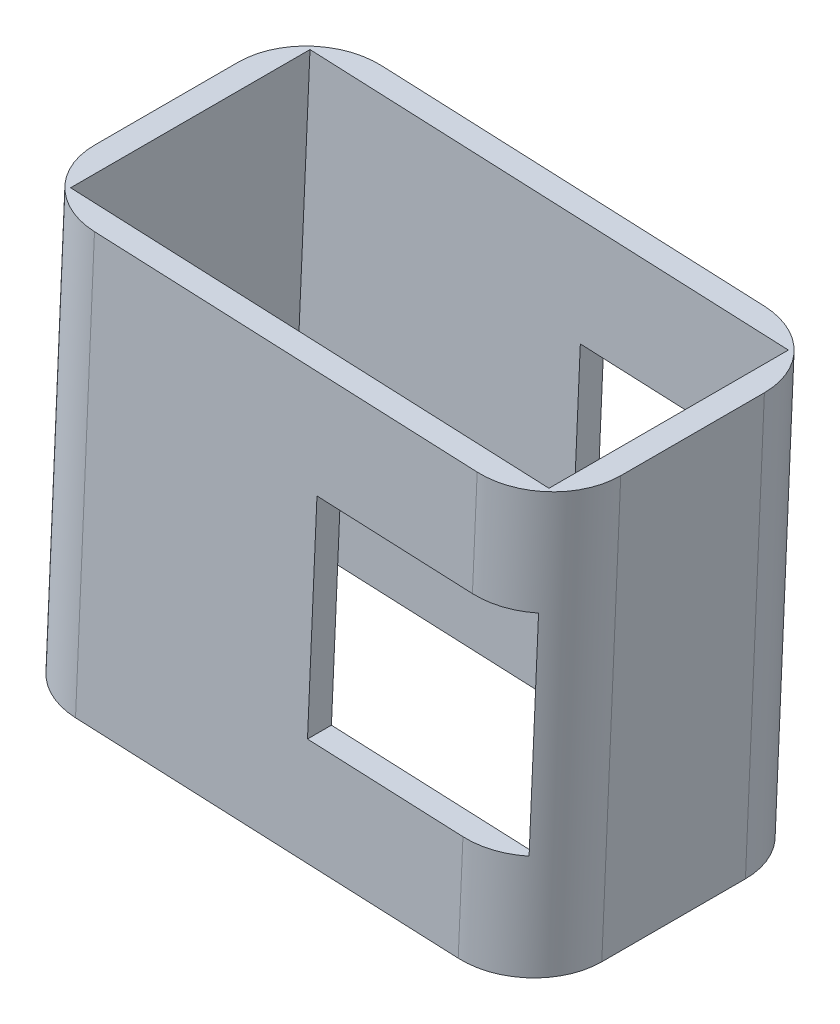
ISO-10303-21;
HEADER;
FILE_DESCRIPTION(('STEP AP214'),'2;1');
FILE_NAME('part.step','',(''),(''),'','','');
FILE_SCHEMA(('AUTOMOTIVE_DESIGN { 1 0 10303 214 1 1 1 1 }'));
ENDSEC;
DATA;
#1=APPLICATION_CONTEXT('core data for automotive mechanical design processes');
#2=APPLICATION_PROTOCOL_DEFINITION('international standard','automotive_design',2000,#1);
#3=PRODUCT_CONTEXT('',#1,'mechanical');
#4=PRODUCT('Part','Part','',(#3));
#5=PRODUCT_RELATED_PRODUCT_CATEGORY('part','',(#4));
#6=PRODUCT_DEFINITION_FORMATION('','',#4);
#7=PRODUCT_DEFINITION_CONTEXT('part definition',#1,'design');
#8=PRODUCT_DEFINITION('design','',#6,#7);
#9=PRODUCT_DEFINITION_SHAPE('','',#8);
#10=(LENGTH_UNIT() NAMED_UNIT(*) SI_UNIT(.MILLI.,.METRE.));
#11=(NAMED_UNIT(*) PLANE_ANGLE_UNIT() SI_UNIT($,.RADIAN.));
#12=(NAMED_UNIT(*) SI_UNIT($,.STERADIAN.) SOLID_ANGLE_UNIT());
#13=UNCERTAINTY_MEASURE_WITH_UNIT(LENGTH_MEASURE(1.E-05),#10,'distance_accuracy_value','');
#14=(GEOMETRIC_REPRESENTATION_CONTEXT(3) GLOBAL_UNCERTAINTY_ASSIGNED_CONTEXT((#13)) GLOBAL_UNIT_ASSIGNED_CONTEXT((#10,
#11,#12)) REPRESENTATION_CONTEXT('',''));
#15=CARTESIAN_POINT('',(0.,0.,0.));
#16=DIRECTION('',(0.,0.,1.));
#17=DIRECTION('',(1.,0.,0.));
#18=AXIS2_PLACEMENT_3D('',#15,#16,#17);
#19=CARTESIAN_POINT('',(-43.1975486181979,10.6937272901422,-39.1));
#20=DIRECTION('',(-0.999030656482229,0.0440198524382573,0.));
#21=DIRECTION('',(-0.0440198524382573,-0.999030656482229,0.));
#22=AXIS2_PLACEMENT_3D('',#19,#20,#21);
#23=PLANE('',#22);
#24=DIRECTION('',(0.,0.,1.));
#25=VECTOR('',#24,1.);
#26=CARTESIAN_POINT('',(-43.5937272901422,1.70245138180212,-39.1));
#27=LINE('',#26,#25);
#28=CARTESIAN_POINT('',(-43.5937272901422,1.70245138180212,-39.1));
#29=VERTEX_POINT('',#28);
#30=CARTESIAN_POINT('',(-43.5937272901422,1.70245138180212,-38.1));
#31=VERTEX_POINT('',#30);
#32=EDGE_CURVE('E188',#29,#31,#27,.T.);
#33=ORIENTED_EDGE('',*,*,#32,.F.);
#34=DIRECTION('',(-0.0440198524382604,-0.999030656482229,0.));
#35=VECTOR('',#34,1.);
#36=CARTESIAN_POINT('',(-43.1975486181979,10.6937272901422,-39.1));
#37=LINE('',#36,#35);
#38=CARTESIAN_POINT('',(-43.1975486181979,10.6937272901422,-39.1));
#39=VERTEX_POINT('',#38);
#40=EDGE_CURVE('E152',#39,#29,#37,.T.);
#41=ORIENTED_EDGE('',*,*,#40,.F.);
#42=DIRECTION('',(0.,0.,1.));
#43=VECTOR('',#42,1.);
#44=CARTESIAN_POINT('',(-43.1975486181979,10.6937272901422,-39.1));
#45=LINE('',#44,#43);
#46=CARTESIAN_POINT('',(-43.1975486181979,10.6937272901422,-38.1));
#47=VERTEX_POINT('',#46);
#48=EDGE_CURVE('E180',#47,#39,#45,.F.);
#49=ORIENTED_EDGE('',*,*,#48,.F.);
#50=DIRECTION('',(0.0440198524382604,0.999030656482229,0.));
#51=VECTOR('',#50,1.);
#52=CARTESIAN_POINT('',(-43.5937272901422,1.70245138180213,-38.1));
#53=LINE('',#52,#51);
#54=EDGE_CURVE('E209',#31,#47,#53,.T.);
#55=ORIENTED_EDGE('',*,*,#54,.F.);
#56=EDGE_LOOP('',(#33,#41,#49,#55));
#57=FACE_BOUND('',#56,.T.);
#58=ADVANCED_FACE('F17',(#57),#23,.F.);
#59=CARTESIAN_POINT('',(-35.1019667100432,1.32828263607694,-39.1));
#60=DIRECTION('',(0.0440198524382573,0.999030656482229,0.));
#61=DIRECTION('',(-0.999030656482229,0.0440198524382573,0.));
#62=AXIS2_PLACEMENT_3D('',#59,#60,#61);
#63=PLANE('',#62);
#64=DIRECTION('',(0.999030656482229,-0.0440198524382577,0.));
#65=VECTOR('',#64,1.);
#66=CARTESIAN_POINT('',(-43.5937272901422,1.70245138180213,-39.1));
#67=LINE('',#66,#65);
#68=CARTESIAN_POINT('',(-37.1000280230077,1.41632234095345,-39.1));
#69=VERTEX_POINT('',#68);
#70=EDGE_CURVE('E144',#29,#69,#67,.T.);
#71=ORIENTED_EDGE('',*,*,#70,.F.);
#72=ORIENTED_EDGE('',*,*,#32,.T.);
#73=DIRECTION('',(-0.999030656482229,0.0440198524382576,0.));
#74=VECTOR('',#73,1.);
#75=CARTESIAN_POINT('',(-35.1019667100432,1.32828263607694,-38.1));
#76=LINE('',#75,#74);
#77=CARTESIAN_POINT('',(-35.1019667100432,1.32828263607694,-38.1));
#78=VERTEX_POINT('',#77);
#79=EDGE_CURVE('E221',#78,#31,#76,.T.);
#80=ORIENTED_EDGE('',*,*,#79,.F.);
#81=DIRECTION('',(0.,0.,1.));
#82=VECTOR('',#81,1.);
#83=CARTESIAN_POINT('',(-35.1019667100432,1.32828263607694,-39.1));
#84=LINE('',#83,#82);
#85=CARTESIAN_POINT('',(-35.1019667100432,1.32828263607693,-38.3360679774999));
#86=VERTEX_POINT('',#85);
#87=EDGE_CURVE('E160',#78,#86,#84,.F.);
#88=ORIENTED_EDGE('',*,*,#87,.T.);
#89=CARTESIAN_POINT('',(-37.1000280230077,1.41632234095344,-36.1));
#90=DIRECTION('',(0.0440198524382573,0.999030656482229,0.));
#91=DIRECTION('',(-0.999030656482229,0.0440198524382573,0.));
#92=AXIS2_PLACEMENT_3D('',#89,#90,#91);
#93=CIRCLE('',#92,3.);
#94=EDGE_CURVE('E20',#69,#86,#93,.F.);
#95=ORIENTED_EDGE('',*,*,#94,.F.);
#96=EDGE_LOOP('',(#71,#72,#80,#88,#95));
#97=FACE_BOUND('',#96,.T.);
#98=ADVANCED_FACE('F158',(#97),#63,.T.);
#99=CARTESIAN_POINT('',(-43.1975486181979,10.6937272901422,-39.1));
#100=DIRECTION('',(-0.0440198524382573,-0.999030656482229,0.));
#101=DIRECTION('',(0.999030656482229,-0.0440198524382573,0.));
#102=AXIS2_PLACEMENT_3D('',#99,#100,#101);
#103=PLANE('',#102);
#104=CARTESIAN_POINT('',(-36.7038493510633,10.4075982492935,-36.1));
#105=DIRECTION('',(0.0440198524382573,0.999030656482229,0.));
#106=DIRECTION('',(-0.999030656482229,0.0440198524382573,0.));
#107=AXIS2_PLACEMENT_3D('',#104,#105,#106);
#108=CIRCLE('',#107,3.);
#109=CARTESIAN_POINT('',(-34.7057880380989,10.319558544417,-38.3360679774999));
#110=VERTEX_POINT('',#109);
#111=CARTESIAN_POINT('',(-36.7038493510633,10.4075982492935,-39.1));
#112=VERTEX_POINT('',#111);
#113=EDGE_CURVE('E164',#110,#112,#108,.T.);
#114=ORIENTED_EDGE('',*,*,#113,.F.);
#115=DIRECTION('',(0.,0.,1.));
#116=VECTOR('',#115,1.);
#117=CARTESIAN_POINT('',(-34.7057880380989,10.319558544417,-39.1));
#118=LINE('',#117,#116);
#119=CARTESIAN_POINT('',(-34.7057880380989,10.319558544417,-38.1));
#120=VERTEX_POINT('',#119);
#121=EDGE_CURVE('E178',#110,#120,#118,.T.);
#122=ORIENTED_EDGE('',*,*,#121,.T.);
#123=DIRECTION('',(0.999030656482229,-0.0440198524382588,0.));
#124=VECTOR('',#123,1.);
#125=CARTESIAN_POINT('',(-43.1975486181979,10.6937272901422,-38.1));
#126=LINE('',#125,#124);
#127=EDGE_CURVE('E206',#47,#120,#126,.T.);
#128=ORIENTED_EDGE('',*,*,#127,.F.);
#129=ORIENTED_EDGE('',*,*,#48,.T.);
#130=DIRECTION('',(-0.999030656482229,0.0440198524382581,0.));
#131=VECTOR('',#130,1.);
#132=CARTESIAN_POINT('',(-36.7038493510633,10.4075982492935,-39.1));
#133=LINE('',#132,#131);
#134=EDGE_CURVE('E193',#112,#39,#133,.T.);
#135=ORIENTED_EDGE('',*,*,#134,.F.);
#136=EDGE_LOOP('',(#114,#122,#128,#129,#135));
#137=FACE_BOUND('',#136,.T.);
#138=ADVANCED_FACE('F453',(#137),#103,.T.);
#139=CARTESIAN_POINT('',(-55.8835211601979,6.74833749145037,-39.1));
#140=DIRECTION('',(-0.999030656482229,0.0440198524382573,0.));
#141=DIRECTION('',(-0.0440198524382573,-0.999030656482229,0.));
#142=AXIS2_PLACEMENT_3D('',#139,#140,#141);
#143=PLANE('',#142);
#144=DIRECTION('',(0.,0.,1.));
#145=VECTOR('',#144,1.);
#146=CARTESIAN_POINT('',(-55.4873424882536,15.7396133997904,-33.1));
#147=LINE('',#146,#145);
#148=CARTESIAN_POINT('',(-55.4873424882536,15.7396133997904,-36.1));
#149=VERTEX_POINT('',#148);
#150=CARTESIAN_POINT('',(-55.4873424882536,15.7396133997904,-30.1));
#151=VERTEX_POINT('',#150);
#152=EDGE_CURVE('E259',#149,#151,#147,.T.);
#153=ORIENTED_EDGE('',*,*,#152,.F.);
#154=DIRECTION('',(0.0440198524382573,0.999030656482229,0.));
#155=VECTOR('',#154,1.);
#156=CARTESIAN_POINT('',(-55.8835211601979,6.74833749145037,-36.1));
#157=LINE('',#156,#155);
#158=CARTESIAN_POINT('',(-56.2796998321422,-2.2429384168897,-36.1));
#159=VERTEX_POINT('',#158);
#160=EDGE_CURVE('E226',#159,#149,#157,.T.);
#161=ORIENTED_EDGE('',*,*,#160,.F.);
#162=DIRECTION('',(0.,0.,1.));
#163=VECTOR('',#162,1.);
#164=CARTESIAN_POINT('',(-56.2796998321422,-2.2429384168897,-33.1));
#165=LINE('',#164,#163);
#166=CARTESIAN_POINT('',(-56.2796998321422,-2.2429384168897,-30.1));
#167=VERTEX_POINT('',#166);
#168=EDGE_CURVE('E272',#159,#167,#165,.T.);
#169=ORIENTED_EDGE('',*,*,#168,.T.);
#170=DIRECTION('',(0.0440198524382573,0.999030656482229,0.));
#171=VECTOR('',#170,1.);
#172=CARTESIAN_POINT('',(-55.8835211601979,6.74833749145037,-30.1));
#173=LINE('',#172,#171);
#174=EDGE_CURVE('E176',#151,#167,#173,.F.);
#175=ORIENTED_EDGE('',*,*,#174,.F.);
#176=EDGE_LOOP('',(#153,#161,#169,#175));
#177=FACE_BOUND('',#176,.T.);
#178=ADVANCED_FACE('F445',(#177),#143,.T.);
#179=CARTESIAN_POINT('',(-52.8864291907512,6.6162779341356,-30.1));
#180=DIRECTION('',(0.0440198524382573,0.999030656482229,0.));
#181=DIRECTION('',(-0.999030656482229,0.0440198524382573,0.));
#182=AXIS2_PLACEMENT_3D('',#179,#180,#181);
#183=CYLINDRICAL_SURFACE('',#182,3.);
#184=CARTESIAN_POINT('',(-53.2826078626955,-2.37499797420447,-30.1));
#185=DIRECTION('',(0.0440198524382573,0.999030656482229,0.));
#186=DIRECTION('',(-0.999030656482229,0.0440198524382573,0.));
#187=AXIS2_PLACEMENT_3D('',#184,#185,#186);
#188=CIRCLE('',#187,3.);
#189=CARTESIAN_POINT('',(-53.2826078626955,-2.37499797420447,-27.1));
#190=VERTEX_POINT('',#189);
#191=EDGE_CURVE('E271',#167,#190,#188,.T.);
#192=ORIENTED_EDGE('',*,*,#191,.T.);
#193=DIRECTION('',(-0.0440198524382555,-0.999030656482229,0.));
#194=VECTOR('',#193,1.);
#195=CARTESIAN_POINT('',(-52.4902505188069,15.6075538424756,-27.1));
#196=LINE('',#195,#194);
#197=CARTESIAN_POINT('',(-52.4902505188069,15.6075538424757,-27.1));
#198=VERTEX_POINT('',#197);
#199=EDGE_CURVE('E274',#198,#190,#196,.T.);
#200=ORIENTED_EDGE('',*,*,#199,.F.);
#201=CARTESIAN_POINT('',(-52.4902505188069,15.6075538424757,-30.1));
#202=DIRECTION('',(0.0440198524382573,0.999030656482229,0.));
#203=DIRECTION('',(-0.999030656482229,0.0440198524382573,0.));
#204=AXIS2_PLACEMENT_3D('',#201,#202,#203);
#205=CIRCLE('',#204,3.);
#206=EDGE_CURVE('E256',#151,#198,#205,.T.);
#207=ORIENTED_EDGE('',*,*,#206,.F.);
#208=ORIENTED_EDGE('',*,*,#174,.T.);
#209=EDGE_LOOP('',(#192,#200,#207,#208));
#210=FACE_BOUND('',#209,.T.);
#211=ADVANCED_FACE('F443',(#210),#183,.T.);
#212=CARTESIAN_POINT('',(-33.9048467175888,5.77990073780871,-27.1));
#213=DIRECTION('',(0.999030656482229,-0.0440198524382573,0.));
#214=DIRECTION('',(0.0440198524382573,0.999030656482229,0.));
#215=AXIS2_PLACEMENT_3D('',#212,#213,#214);
#216=PLANE('',#215);
#217=DIRECTION('',(0.,0.,1.));
#218=VECTOR('',#217,1.);
#219=CARTESIAN_POINT('',(-34.3010253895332,-3.21137517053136,-33.1));
#220=LINE('',#219,#218);
#221=CARTESIAN_POINT('',(-34.3010253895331,-3.21137517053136,-30.1));
#222=VERTEX_POINT('',#221);
#223=CARTESIAN_POINT('',(-34.3010253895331,-3.21137517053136,-36.1));
#224=VERTEX_POINT('',#223);
#225=EDGE_CURVE('E266',#222,#224,#220,.F.);
#226=ORIENTED_EDGE('',*,*,#225,.T.);
#227=DIRECTION('',(0.0440198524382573,0.999030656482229,0.));
#228=VECTOR('',#227,1.);
#229=CARTESIAN_POINT('',(-33.9048467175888,5.77990073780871,-36.1));
#230=LINE('',#229,#228);
#231=CARTESIAN_POINT('',(-33.5086680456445,14.7711766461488,-36.1));
#232=VERTEX_POINT('',#231);
#233=EDGE_CURVE('E170',#232,#224,#230,.F.);
#234=ORIENTED_EDGE('',*,*,#233,.F.);
#235=DIRECTION('',(0.,0.,1.));
#236=VECTOR('',#235,1.);
#237=CARTESIAN_POINT('',(-33.5086680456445,14.7711766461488,-33.1));
#238=LINE('',#237,#236);
#239=CARTESIAN_POINT('',(-33.5086680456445,14.7711766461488,-30.1));
#240=VERTEX_POINT('',#239);
#241=EDGE_CURVE('E251',#240,#232,#238,.F.);
#242=ORIENTED_EDGE('',*,*,#241,.F.);
#243=DIRECTION('',(0.0440198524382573,0.999030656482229,0.));
#244=VECTOR('',#243,1.);
#245=CARTESIAN_POINT('',(-33.9048467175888,5.77990073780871,-30.1));
#246=LINE('',#245,#244);
#247=EDGE_CURVE('E282',#222,#240,#246,.T.);
#248=ORIENTED_EDGE('',*,*,#247,.F.);
#249=EDGE_LOOP('',(#226,#234,#242,#248));
#250=FACE_BOUND('',#249,.T.);
#251=ADVANCED_FACE('F438',(#250),#216,.T.);
#252=CARTESIAN_POINT('',(-33.9048467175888,5.77990073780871,-39.1));
#253=DIRECTION('',(0.,0.,-1.));
#254=DIRECTION('',(-1.,0.,0.));
#255=AXIS2_PLACEMENT_3D('',#252,#253,#254);
#256=PLANE('',#255);
#257=ORIENTED_EDGE('',*,*,#40,.T.);
#258=ORIENTED_EDGE('',*,*,#70,.T.);
#259=DIRECTION('',(0.0440198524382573,0.999030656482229,0.));
#260=VECTOR('',#259,1.);
#261=CARTESIAN_POINT('',(-36.9019386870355,5.91196029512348,-39.1));
#262=LINE('',#261,#260);
#263=CARTESIAN_POINT('',(-37.2981173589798,-3.07931561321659,-39.1));
#264=VERTEX_POINT('',#263);
#265=EDGE_CURVE('E148',#264,#69,#262,.T.);
#266=ORIENTED_EDGE('',*,*,#265,.F.);
#267=DIRECTION('',(-0.999030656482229,0.0440198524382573,0.));
#268=VECTOR('',#267,1.);
#269=CARTESIAN_POINT('',(-45.2903626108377,-2.72715679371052,-39.1));
#270=LINE('',#269,#268);
#271=CARTESIAN_POINT('',(-53.2826078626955,-2.37499797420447,-39.1));
#272=VERTEX_POINT('',#271);
#273=EDGE_CURVE('E264',#264,#272,#270,.T.);
#274=ORIENTED_EDGE('',*,*,#273,.T.);
#275=DIRECTION('',(0.0440198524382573,0.999030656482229,0.));
#276=VECTOR('',#275,1.);
#277=CARTESIAN_POINT('',(-52.8864291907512,6.6162779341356,-39.1));
#278=LINE('',#277,#276);
#279=CARTESIAN_POINT('',(-52.4902505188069,15.6075538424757,-39.1));
#280=VERTEX_POINT('',#279);
#281=EDGE_CURVE('E154',#280,#272,#278,.F.);
#282=ORIENTED_EDGE('',*,*,#281,.F.);
#283=DIRECTION('',(-0.999030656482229,0.0440198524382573,0.));
#284=VECTOR('',#283,1.);
#285=CARTESIAN_POINT('',(-44.4980052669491,15.2553950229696,-39.1));
#286=LINE('',#285,#284);
#287=CARTESIAN_POINT('',(-36.5057600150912,14.9032362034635,-39.1));
#288=VERTEX_POINT('',#287);
#289=EDGE_CURVE('E247',#288,#280,#286,.T.);
#290=ORIENTED_EDGE('',*,*,#289,.F.);
#291=DIRECTION('',(0.0440198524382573,0.999030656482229,0.));
#292=VECTOR('',#291,1.);
#293=CARTESIAN_POINT('',(-36.9019386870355,5.91196029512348,-39.1));
#294=LINE('',#293,#292);
#295=EDGE_CURVE('E172',#112,#288,#294,.T.);
#296=ORIENTED_EDGE('',*,*,#295,.F.);
#297=ORIENTED_EDGE('',*,*,#134,.T.);
#298=EDGE_LOOP('',(#257,#258,#266,#274,#282,#290,#296,#297));
#299=FACE_BOUND('',#298,.T.);
#300=ADVANCED_FACE('F146',(#299),#256,.T.);
#301=CARTESIAN_POINT('',(-52.8864291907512,6.6162779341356,-36.1));
#302=DIRECTION('',(0.0440198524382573,0.999030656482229,0.));
#303=DIRECTION('',(-0.999030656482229,0.0440198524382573,0.));
#304=AXIS2_PLACEMENT_3D('',#301,#302,#303);
#305=CYLINDRICAL_SURFACE('',#304,3.);
#306=CARTESIAN_POINT('',(-53.2826078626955,-2.37499797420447,-36.1));
#307=DIRECTION('',(0.0440198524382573,0.999030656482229,0.));
#308=DIRECTION('',(-0.999030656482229,0.0440198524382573,0.));
#309=AXIS2_PLACEMENT_3D('',#306,#307,#308);
#310=CIRCLE('',#309,3.);
#311=EDGE_CURVE('E260',#272,#159,#310,.T.);
#312=ORIENTED_EDGE('',*,*,#311,.T.);
#313=ORIENTED_EDGE('',*,*,#160,.T.);
#314=CARTESIAN_POINT('',(-52.4902505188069,15.6075538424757,-36.1));
#315=DIRECTION('',(0.0440198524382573,0.999030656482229,0.));
#316=DIRECTION('',(-0.999030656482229,0.0440198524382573,0.));
#317=AXIS2_PLACEMENT_3D('',#314,#315,#316);
#318=CIRCLE('',#317,3.);
#319=EDGE_CURVE('E243',#280,#149,#318,.T.);
#320=ORIENTED_EDGE('',*,*,#319,.F.);
#321=ORIENTED_EDGE('',*,*,#281,.T.);
#322=EDGE_LOOP('',(#312,#313,#320,#321));
#323=FACE_BOUND('',#322,.T.);
#324=ADVANCED_FACE('F448',(#323),#305,.T.);
#325=CARTESIAN_POINT('',(-54.8844905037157,6.70431763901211,-38.1));
#326=DIRECTION('',(0.,0.,1.));
#327=DIRECTION('',(1.,0.,0.));
#328=AXIS2_PLACEMENT_3D('',#325,#326,#327);
#329=PLANE('',#328);
#330=ORIENTED_EDGE('',*,*,#54,.T.);
#331=ORIENTED_EDGE('',*,*,#127,.T.);
#332=DIRECTION('',(0.0440198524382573,0.999030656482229,0.));
#333=VECTOR('',#332,1.);
#334=CARTESIAN_POINT('',(-34.903877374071,5.82392059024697,-38.1));
#335=LINE('',#334,#333);
#336=CARTESIAN_POINT('',(-34.5076987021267,14.815196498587,-38.1));
#337=VERTEX_POINT('',#336);
#338=EDGE_CURVE('E212',#120,#337,#335,.T.);
#339=ORIENTED_EDGE('',*,*,#338,.T.);
#340=DIRECTION('',(-0.999030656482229,0.0440198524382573,0.));
#341=VECTOR('',#340,1.);
#342=CARTESIAN_POINT('',(-44.4980052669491,15.2553950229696,-38.1));
#343=LINE('',#342,#341);
#344=CARTESIAN_POINT('',(-54.4883118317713,15.6955935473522,-38.1));
#345=VERTEX_POINT('',#344);
#346=EDGE_CURVE('E216',#345,#337,#343,.F.);
#347=ORIENTED_EDGE('',*,*,#346,.F.);
#348=DIRECTION('',(-0.0440198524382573,-0.999030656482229,0.));
#349=VECTOR('',#348,1.);
#350=CARTESIAN_POINT('',(-54.8844905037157,6.70431763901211,-38.1));
#351=LINE('',#350,#349);
#352=CARTESIAN_POINT('',(-55.28066917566,-2.28695826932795,-38.1));
#353=VERTEX_POINT('',#352);
#354=EDGE_CURVE('E335',#345,#353,#351,.T.);
#355=ORIENTED_EDGE('',*,*,#354,.T.);
#356=DIRECTION('',(-0.999030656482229,0.0440198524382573,0.));
#357=VECTOR('',#356,1.);
#358=CARTESIAN_POINT('',(-45.2903626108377,-2.72715679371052,-38.1));
#359=LINE('',#358,#357);
#360=CARTESIAN_POINT('',(-35.3000560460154,-3.1673553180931,-38.1));
#361=VERTEX_POINT('',#360);
#362=EDGE_CURVE('E263',#353,#361,#359,.F.);
#363=ORIENTED_EDGE('',*,*,#362,.T.);
#364=DIRECTION('',(0.0440198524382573,0.999030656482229,0.));
#365=VECTOR('',#364,1.);
#366=CARTESIAN_POINT('',(-34.903877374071,5.82392059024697,-38.1));
#367=LINE('',#366,#365);
#368=EDGE_CURVE('E186',#361,#78,#367,.T.);
#369=ORIENTED_EDGE('',*,*,#368,.T.);
#370=ORIENTED_EDGE('',*,*,#79,.T.);
#371=EDGE_LOOP('',(#330,#331,#339,#347,#355,#363,#369,#370));
#372=FACE_BOUND('',#371,.T.);
#373=ADVANCED_FACE('F405',(#372),#329,.T.);
#374=CARTESIAN_POINT('',(-36.9019386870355,5.91196029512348,-36.1));
#375=DIRECTION('',(0.0440198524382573,0.999030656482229,0.));
#376=DIRECTION('',(-0.999030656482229,0.0440198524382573,0.));
#377=AXIS2_PLACEMENT_3D('',#374,#375,#376);
#378=CYLINDRICAL_SURFACE('',#377,3.);
#379=DIRECTION('',(0.0440198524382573,0.999030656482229,0.));
#380=VECTOR('',#379,1.);
#381=CARTESIAN_POINT('',(-34.903877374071,5.82392059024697,-38.3360679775));
#382=LINE('',#381,#380);
#383=EDGE_CURVE('E183',#86,#110,#382,.T.);
#384=ORIENTED_EDGE('',*,*,#383,.T.);
#385=ORIENTED_EDGE('',*,*,#113,.T.);
#386=ORIENTED_EDGE('',*,*,#295,.T.);
#387=CARTESIAN_POINT('',(-36.5057600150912,14.9032362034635,-36.1));
#388=DIRECTION('',(0.0440198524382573,0.999030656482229,0.));
#389=DIRECTION('',(-0.999030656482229,0.0440198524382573,0.));
#390=AXIS2_PLACEMENT_3D('',#387,#388,#389);
#391=CIRCLE('',#390,3.);
#392=EDGE_CURVE('E248',#232,#288,#391,.T.);
#393=ORIENTED_EDGE('',*,*,#392,.F.);
#394=ORIENTED_EDGE('',*,*,#233,.T.);
#395=CARTESIAN_POINT('',(-37.2981173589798,-3.07931561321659,-36.1));
#396=DIRECTION('',(0.0440198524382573,0.999030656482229,0.));
#397=DIRECTION('',(-0.999030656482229,0.0440198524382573,0.));
#398=AXIS2_PLACEMENT_3D('',#395,#396,#397);
#399=CIRCLE('',#398,3.);
#400=EDGE_CURVE('E168',#224,#264,#399,.T.);
#401=ORIENTED_EDGE('',*,*,#400,.T.);
#402=ORIENTED_EDGE('',*,*,#265,.T.);
#403=ORIENTED_EDGE('',*,*,#94,.T.);
#404=EDGE_LOOP('',(#384,#385,#386,#393,#394,#401,#402,#403));
#405=FACE_BOUND('',#404,.T.);
#406=ADVANCED_FACE('F165',(#405),#378,.T.);
#407=CARTESIAN_POINT('',(-55.8835211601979,6.74833749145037,-27.1));
#408=DIRECTION('',(0.,0.,1.));
#409=DIRECTION('',(1.,0.,0.));
#410=AXIS2_PLACEMENT_3D('',#407,#408,#409);
#411=PLANE('',#410);
#412=DIRECTION('',(-0.0440198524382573,-0.999030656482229,0.));
#413=VECTOR('',#412,1.);
#414=CARTESIAN_POINT('',(-43.1975486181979,10.6937272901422,-27.1));
#415=LINE('',#414,#413);
#416=CARTESIAN_POINT('',(-43.5937272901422,1.70245138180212,-27.1));
#417=VERTEX_POINT('',#416);
#418=CARTESIAN_POINT('',(-43.1975486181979,10.6937272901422,-27.1));
#419=VERTEX_POINT('',#418);
#420=EDGE_CURVE('E308',#417,#419,#415,.F.);
#421=ORIENTED_EDGE('',*,*,#420,.T.);
#422=DIRECTION('',(0.999030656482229,-0.0440198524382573,0.));
#423=VECTOR('',#422,1.);
#424=CARTESIAN_POINT('',(-43.1975486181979,10.6937272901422,-27.1));
#425=LINE('',#424,#423);
#426=CARTESIAN_POINT('',(-36.7038493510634,10.4075982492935,-27.1));
#427=VERTEX_POINT('',#426);
#428=EDGE_CURVE('E242',#427,#419,#425,.F.);
#429=ORIENTED_EDGE('',*,*,#428,.F.);
#430=DIRECTION('',(0.0440198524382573,0.999030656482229,0.));
#431=VECTOR('',#430,1.);
#432=CARTESIAN_POINT('',(-36.9019386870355,5.91196029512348,-27.1));
#433=LINE('',#432,#431);
#434=CARTESIAN_POINT('',(-36.5057600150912,14.9032362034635,-27.1));
#435=VERTEX_POINT('',#434);
#436=EDGE_CURVE('E285',#435,#427,#433,.F.);
#437=ORIENTED_EDGE('',*,*,#436,.F.);
#438=DIRECTION('',(-0.999030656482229,0.0440198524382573,0.));
#439=VECTOR('',#438,1.);
#440=CARTESIAN_POINT('',(-44.4980052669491,15.2553950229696,-27.1));
#441=LINE('',#440,#439);
#442=EDGE_CURVE('E255',#198,#435,#441,.F.);
#443=ORIENTED_EDGE('',*,*,#442,.F.);
#444=ORIENTED_EDGE('',*,*,#199,.T.);
#445=DIRECTION('',(-0.999030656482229,0.0440198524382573,0.));
#446=VECTOR('',#445,1.);
#447=CARTESIAN_POINT('',(-45.2903626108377,-2.72715679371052,-27.1));
#448=LINE('',#447,#446);
#449=CARTESIAN_POINT('',(-37.2981173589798,-3.07931561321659,-27.1));
#450=VERTEX_POINT('',#449);
#451=EDGE_CURVE('E270',#190,#450,#448,.F.);
#452=ORIENTED_EDGE('',*,*,#451,.T.);
#453=DIRECTION('',(0.0440198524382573,0.999030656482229,0.));
#454=VECTOR('',#453,1.);
#455=CARTESIAN_POINT('',(-36.9019386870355,5.91196029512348,-27.1));
#456=LINE('',#455,#454);
#457=CARTESIAN_POINT('',(-37.1000280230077,1.41632234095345,-27.1));
#458=VERTEX_POINT('',#457);
#459=EDGE_CURVE('E277',#458,#450,#456,.F.);
#460=ORIENTED_EDGE('',*,*,#459,.F.);
#461=DIRECTION('',(-0.999030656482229,0.0440198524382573,0.));
#462=VECTOR('',#461,1.);
#463=CARTESIAN_POINT('',(-35.1019667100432,1.32828263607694,-27.1));
#464=LINE('',#463,#462);
#465=EDGE_CURVE('E238',#417,#458,#464,.F.);
#466=ORIENTED_EDGE('',*,*,#465,.F.);
#467=EDGE_LOOP('',(#421,#429,#437,#443,#444,#452,#460,#466));
#468=FACE_BOUND('',#467,.T.);
#469=ADVANCED_FACE('F431',(#468),#411,.T.);
#470=CARTESIAN_POINT('',(-36.9019386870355,5.91196029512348,-30.1));
#471=DIRECTION('',(0.0440198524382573,0.999030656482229,0.));
#472=DIRECTION('',(-0.999030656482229,0.0440198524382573,0.));
#473=AXIS2_PLACEMENT_3D('',#470,#471,#472);
#474=CYLINDRICAL_SURFACE('',#473,3.);
#475=DIRECTION('',(0.0440198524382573,0.999030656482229,0.));
#476=VECTOR('',#475,1.);
#477=CARTESIAN_POINT('',(-34.903877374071,5.82392059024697,-27.8639320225));
#478=LINE('',#477,#476);
#479=CARTESIAN_POINT('',(-34.7057880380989,10.319558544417,-27.8639320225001));
#480=VERTEX_POINT('',#479);
#481=CARTESIAN_POINT('',(-35.1019667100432,1.32828263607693,-27.8639320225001));
#482=VERTEX_POINT('',#481);
#483=EDGE_CURVE('E327',#480,#482,#478,.F.);
#484=ORIENTED_EDGE('',*,*,#483,.T.);
#485=CARTESIAN_POINT('',(-37.1000280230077,1.41632234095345,-30.1));
#486=DIRECTION('',(0.0440198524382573,0.999030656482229,0.));
#487=DIRECTION('',(-0.999030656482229,0.0440198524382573,0.));
#488=AXIS2_PLACEMENT_3D('',#485,#486,#487);
#489=CIRCLE('',#488,3.);
#490=EDGE_CURVE('E234',#458,#482,#489,.T.);
#491=ORIENTED_EDGE('',*,*,#490,.F.);
#492=ORIENTED_EDGE('',*,*,#459,.T.);
#493=CARTESIAN_POINT('',(-37.2981173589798,-3.07931561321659,-30.1));
#494=DIRECTION('',(0.0440198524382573,0.999030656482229,0.));
#495=DIRECTION('',(-0.999030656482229,0.0440198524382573,0.));
#496=AXIS2_PLACEMENT_3D('',#493,#494,#495);
#497=CIRCLE('',#496,3.);
#498=EDGE_CURVE('E267',#450,#222,#497,.T.);
#499=ORIENTED_EDGE('',*,*,#498,.T.);
#500=ORIENTED_EDGE('',*,*,#247,.T.);
#501=CARTESIAN_POINT('',(-36.5057600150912,14.9032362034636,-30.1));
#502=DIRECTION('',(0.0440198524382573,0.999030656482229,0.));
#503=DIRECTION('',(-0.999030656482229,0.0440198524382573,0.));
#504=AXIS2_PLACEMENT_3D('',#501,#502,#503);
#505=CIRCLE('',#504,3.);
#506=EDGE_CURVE('E252',#435,#240,#505,.T.);
#507=ORIENTED_EDGE('',*,*,#506,.F.);
#508=ORIENTED_EDGE('',*,*,#436,.T.);
#509=CARTESIAN_POINT('',(-36.7038493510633,10.4075982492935,-30.1));
#510=DIRECTION('',(0.0440198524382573,0.999030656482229,0.));
#511=DIRECTION('',(-0.999030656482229,0.0440198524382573,0.));
#512=AXIS2_PLACEMENT_3D('',#509,#510,#511);
#513=CIRCLE('',#512,3.);
#514=EDGE_CURVE('E239',#480,#427,#513,.F.);
#515=ORIENTED_EDGE('',*,*,#514,.F.);
#516=EDGE_LOOP('',(#484,#491,#492,#499,#500,#507,#508,#515));
#517=FACE_BOUND('',#516,.T.);
#518=ADVANCED_FACE('F422',(#517),#474,.T.);
#519=CARTESIAN_POINT('',(-45.2903626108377,-2.72715679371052,-33.1));
#520=DIRECTION('',(0.0440198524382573,0.999030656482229,0.));
#521=DIRECTION('',(-0.999030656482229,0.0440198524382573,0.));
#522=AXIS2_PLACEMENT_3D('',#519,#520,#521);
#523=PLANE('',#522);
#524=ORIENTED_EDGE('',*,*,#362,.F.);
#525=DIRECTION('',(0.,0.,1.));
#526=VECTOR('',#525,1.);
#527=CARTESIAN_POINT('',(-55.28066917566,-2.28695826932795,-38.1));
#528=LINE('',#527,#526);
#529=CARTESIAN_POINT('',(-55.28066917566,-2.28695826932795,-28.1));
#530=VERTEX_POINT('',#529);
#531=EDGE_CURVE('E338',#353,#530,#528,.T.);
#532=ORIENTED_EDGE('',*,*,#531,.T.);
#533=DIRECTION('',(-0.999030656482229,0.0440198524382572,0.));
#534=VECTOR('',#533,1.);
#535=CARTESIAN_POINT('',(-35.3000560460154,-3.16735531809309,-28.1));
#536=LINE('',#535,#534);
#537=CARTESIAN_POINT('',(-35.3000560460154,-3.1673553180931,-28.1));
#538=VERTEX_POINT('',#537);
#539=EDGE_CURVE('E326',#538,#530,#536,.T.);
#540=ORIENTED_EDGE('',*,*,#539,.F.);
#541=DIRECTION('',(0.,0.,1.));
#542=VECTOR('',#541,1.);
#543=CARTESIAN_POINT('',(-35.3000560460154,-3.1673553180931,-28.1));
#544=LINE('',#543,#542);
#545=EDGE_CURVE('E231',#538,#361,#544,.F.);
#546=ORIENTED_EDGE('',*,*,#545,.T.);
#547=EDGE_LOOP('',(#524,#532,#540,#546));
#548=FACE_BOUND('',#547,.T.);
#549=ORIENTED_EDGE('',*,*,#273,.F.);
#550=ORIENTED_EDGE('',*,*,#400,.F.);
#551=ORIENTED_EDGE('',*,*,#225,.F.);
#552=ORIENTED_EDGE('',*,*,#498,.F.);
#553=ORIENTED_EDGE('',*,*,#451,.F.);
#554=ORIENTED_EDGE('',*,*,#191,.F.);
#555=ORIENTED_EDGE('',*,*,#168,.F.);
#556=ORIENTED_EDGE('',*,*,#311,.F.);
#557=EDGE_LOOP('',(#549,#550,#551,#552,#553,#554,#555,#556));
#558=FACE_BOUND('',#557,.T.);
#559=ADVANCED_FACE('F408',(#548,#558),#523,.F.);
#560=CARTESIAN_POINT('',(-54.8844905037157,6.70431763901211,-38.1));
#561=DIRECTION('',(-0.999030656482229,0.0440198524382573,0.));
#562=DIRECTION('',(-0.0440198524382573,-0.999030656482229,0.));
#563=AXIS2_PLACEMENT_3D('',#560,#561,#562);
#564=PLANE('',#563);
#565=DIRECTION('',(0.0440198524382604,0.999030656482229,0.));
#566=VECTOR('',#565,1.);
#567=CARTESIAN_POINT('',(-55.28066917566,-2.28695826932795,-28.1));
#568=LINE('',#567,#566);
#569=CARTESIAN_POINT('',(-54.4883118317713,15.6955935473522,-28.1));
#570=VERTEX_POINT('',#569);
#571=EDGE_CURVE('E375',#530,#570,#568,.T.);
#572=ORIENTED_EDGE('',*,*,#571,.F.);
#573=ORIENTED_EDGE('',*,*,#531,.F.);
#574=ORIENTED_EDGE('',*,*,#354,.F.);
#575=DIRECTION('',(0.,0.,1.));
#576=VECTOR('',#575,1.);
#577=CARTESIAN_POINT('',(-54.4883118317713,15.6955935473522,-33.1));
#578=LINE('',#577,#576);
#579=EDGE_CURVE('E246',#570,#345,#578,.F.);
#580=ORIENTED_EDGE('',*,*,#579,.F.);
#581=EDGE_LOOP('',(#572,#573,#574,#580));
#582=FACE_BOUND('',#581,.T.);
#583=ADVANCED_FACE('F412',(#582),#564,.F.);
#584=CARTESIAN_POINT('',(-44.4980052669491,15.2553950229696,-33.1));
#585=DIRECTION('',(0.0440198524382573,0.999030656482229,0.));
#586=DIRECTION('',(-0.999030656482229,0.0440198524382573,0.));
#587=AXIS2_PLACEMENT_3D('',#584,#585,#586);
#588=PLANE('',#587);
#589=ORIENTED_EDGE('',*,*,#346,.T.);
#590=DIRECTION('',(0.,0.,1.));
#591=VECTOR('',#590,1.);
#592=CARTESIAN_POINT('',(-34.5076987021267,14.815196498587,-28.1));
#593=LINE('',#592,#591);
#594=CARTESIAN_POINT('',(-34.5076987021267,14.815196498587,-28.1));
#595=VERTEX_POINT('',#594);
#596=EDGE_CURVE('E215',#337,#595,#593,.T.);
#597=ORIENTED_EDGE('',*,*,#596,.T.);
#598=DIRECTION('',(0.999030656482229,-0.0440198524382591,0.));
#599=VECTOR('',#598,1.);
#600=CARTESIAN_POINT('',(-54.4883118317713,15.6955935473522,-28.1));
#601=LINE('',#600,#599);
#602=EDGE_CURVE('E298',#570,#595,#601,.T.);
#603=ORIENTED_EDGE('',*,*,#602,.F.);
#604=ORIENTED_EDGE('',*,*,#579,.T.);
#605=EDGE_LOOP('',(#589,#597,#603,#604));
#606=FACE_BOUND('',#605,.T.);
#607=ORIENTED_EDGE('',*,*,#289,.T.);
#608=ORIENTED_EDGE('',*,*,#319,.T.);
#609=ORIENTED_EDGE('',*,*,#152,.T.);
#610=ORIENTED_EDGE('',*,*,#206,.T.);
#611=ORIENTED_EDGE('',*,*,#442,.T.);
#612=ORIENTED_EDGE('',*,*,#506,.T.);
#613=ORIENTED_EDGE('',*,*,#241,.T.);
#614=ORIENTED_EDGE('',*,*,#392,.T.);
#615=EDGE_LOOP('',(#607,#608,#609,#610,#611,#612,#613,#614));
#616=FACE_BOUND('',#615,.T.);
#617=ADVANCED_FACE('F387',(#606,#616),#588,.T.);
#618=CARTESIAN_POINT('',(-34.903877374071,5.82392059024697,-28.1));
#619=DIRECTION('',(0.999030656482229,-0.0440198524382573,0.));
#620=DIRECTION('',(0.0440198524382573,0.999030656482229,0.));
#621=AXIS2_PLACEMENT_3D('',#618,#619,#620);
#622=PLANE('',#621);
#623=ORIENTED_EDGE('',*,*,#383,.F.);
#624=ORIENTED_EDGE('',*,*,#87,.F.);
#625=ORIENTED_EDGE('',*,*,#368,.F.);
#626=ORIENTED_EDGE('',*,*,#545,.F.);
#627=DIRECTION('',(-0.0440198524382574,-0.999030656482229,0.));
#628=VECTOR('',#627,1.);
#629=CARTESIAN_POINT('',(-35.1019667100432,1.32828263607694,-28.1));
#630=LINE('',#629,#628);
#631=CARTESIAN_POINT('',(-35.1019667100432,1.32828263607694,-28.1));
#632=VERTEX_POINT('',#631);
#633=EDGE_CURVE('E323',#632,#538,#630,.T.);
#634=ORIENTED_EDGE('',*,*,#633,.F.);
#635=DIRECTION('',(0.,0.,1.));
#636=VECTOR('',#635,1.);
#637=CARTESIAN_POINT('',(-35.1019667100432,1.32828263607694,-39.1));
#638=LINE('',#637,#636);
#639=EDGE_CURVE('E237',#482,#632,#638,.F.);
#640=ORIENTED_EDGE('',*,*,#639,.F.);
#641=ORIENTED_EDGE('',*,*,#483,.F.);
#642=DIRECTION('',(0.,0.,1.));
#643=VECTOR('',#642,1.);
#644=CARTESIAN_POINT('',(-34.7057880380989,10.319558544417,-39.1));
#645=LINE('',#644,#643);
#646=CARTESIAN_POINT('',(-34.7057880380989,10.319558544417,-28.1));
#647=VERTEX_POINT('',#646);
#648=EDGE_CURVE('E185',#647,#480,#645,.T.);
#649=ORIENTED_EDGE('',*,*,#648,.F.);
#650=DIRECTION('',(-0.044019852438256,-0.999030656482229,0.));
#651=VECTOR('',#650,1.);
#652=CARTESIAN_POINT('',(-34.5076987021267,14.815196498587,-28.1));
#653=LINE('',#652,#651);
#654=EDGE_CURVE('E294',#595,#647,#653,.T.);
#655=ORIENTED_EDGE('',*,*,#654,.F.);
#656=ORIENTED_EDGE('',*,*,#596,.F.);
#657=ORIENTED_EDGE('',*,*,#338,.F.);
#658=ORIENTED_EDGE('',*,*,#121,.F.);
#659=EDGE_LOOP('',(#623,#624,#625,#626,#634,#640,#641,#649,#655,#656,#657,#658));
#660=FACE_BOUND('',#659,.T.);
#661=ADVANCED_FACE('F416',(#660),#622,.F.);
#662=CARTESIAN_POINT('',(-43.1975486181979,10.6937272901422,-39.1));
#663=DIRECTION('',(-0.0440198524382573,-0.999030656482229,0.));
#664=DIRECTION('',(0.999030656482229,-0.0440198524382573,0.));
#665=AXIS2_PLACEMENT_3D('',#662,#663,#664);
#666=PLANE('',#665);
#667=ORIENTED_EDGE('',*,*,#428,.T.);
#668=DIRECTION('',(0.,0.,1.));
#669=VECTOR('',#668,1.);
#670=CARTESIAN_POINT('',(-43.1975486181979,10.6937272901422,-39.1));
#671=LINE('',#670,#669);
#672=CARTESIAN_POINT('',(-43.1975486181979,10.6937272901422,-28.1));
#673=VERTEX_POINT('',#672);
#674=EDGE_CURVE('E306',#419,#673,#671,.F.);
#675=ORIENTED_EDGE('',*,*,#674,.T.);
#676=DIRECTION('',(-0.999030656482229,0.0440198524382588,0.));
#677=VECTOR('',#676,1.);
#678=CARTESIAN_POINT('',(-34.7057880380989,10.319558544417,-28.1));
#679=LINE('',#678,#677);
#680=EDGE_CURVE('E297',#647,#673,#679,.T.);
#681=ORIENTED_EDGE('',*,*,#680,.F.);
#682=ORIENTED_EDGE('',*,*,#648,.T.);
#683=ORIENTED_EDGE('',*,*,#514,.T.);
#684=EDGE_LOOP('',(#667,#675,#681,#682,#683));
#685=FACE_BOUND('',#684,.T.);
#686=ADVANCED_FACE('F427',(#685),#666,.T.);
#687=CARTESIAN_POINT('',(-43.1975486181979,10.6937272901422,-39.1));
#688=DIRECTION('',(-0.999030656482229,0.0440198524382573,0.));
#689=DIRECTION('',(-0.0440198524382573,-0.999030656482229,0.));
#690=AXIS2_PLACEMENT_3D('',#687,#688,#689);
#691=PLANE('',#690);
#692=ORIENTED_EDGE('',*,*,#420,.F.);
#693=DIRECTION('',(0.,0.,1.));
#694=VECTOR('',#693,1.);
#695=CARTESIAN_POINT('',(-43.5937272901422,1.70245138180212,-39.1));
#696=LINE('',#695,#694);
#697=CARTESIAN_POINT('',(-43.5937272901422,1.70245138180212,-28.1));
#698=VERTEX_POINT('',#697);
#699=EDGE_CURVE('E35',#698,#417,#696,.T.);
#700=ORIENTED_EDGE('',*,*,#699,.F.);
#701=DIRECTION('',(-0.0440198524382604,-0.999030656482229,0.));
#702=VECTOR('',#701,1.);
#703=CARTESIAN_POINT('',(-43.1975486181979,10.6937272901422,-28.1));
#704=LINE('',#703,#702);
#705=EDGE_CURVE('E26',#673,#698,#704,.T.);
#706=ORIENTED_EDGE('',*,*,#705,.F.);
#707=ORIENTED_EDGE('',*,*,#674,.F.);
#708=EDGE_LOOP('',(#692,#700,#706,#707));
#709=FACE_BOUND('',#708,.T.);
#710=ADVANCED_FACE('F429',(#709),#691,.F.);
#711=CARTESIAN_POINT('',(-35.1019667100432,1.32828263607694,-39.1));
#712=DIRECTION('',(0.0440198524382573,0.999030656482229,0.));
#713=DIRECTION('',(-0.999030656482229,0.0440198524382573,0.));
#714=AXIS2_PLACEMENT_3D('',#711,#712,#713);
#715=PLANE('',#714);
#716=ORIENTED_EDGE('',*,*,#490,.T.);
#717=ORIENTED_EDGE('',*,*,#639,.T.);
#718=DIRECTION('',(0.999030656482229,-0.0440198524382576,0.));
#719=VECTOR('',#718,1.);
#720=CARTESIAN_POINT('',(-43.5937272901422,1.70245138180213,-28.1));
#721=LINE('',#720,#719);
#722=EDGE_CURVE('E11',#698,#632,#721,.T.);
#723=ORIENTED_EDGE('',*,*,#722,.F.);
#724=ORIENTED_EDGE('',*,*,#699,.T.);
#725=ORIENTED_EDGE('',*,*,#465,.T.);
#726=EDGE_LOOP('',(#716,#717,#723,#724,#725));
#727=FACE_BOUND('',#726,.T.);
#728=ADVANCED_FACE('F418',(#727),#715,.T.);
#729=CARTESIAN_POINT('',(-34.903877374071,5.82392059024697,-28.1));
#730=DIRECTION('',(0.,0.,-1.));
#731=DIRECTION('',(-1.,0.,0.));
#732=AXIS2_PLACEMENT_3D('',#729,#730,#731);
#733=PLANE('',#732);
#734=ORIENTED_EDGE('',*,*,#705,.T.);
#735=ORIENTED_EDGE('',*,*,#722,.T.);
#736=ORIENTED_EDGE('',*,*,#633,.T.);
#737=ORIENTED_EDGE('',*,*,#539,.T.);
#738=ORIENTED_EDGE('',*,*,#571,.T.);
#739=ORIENTED_EDGE('',*,*,#602,.T.);
#740=ORIENTED_EDGE('',*,*,#654,.T.);
#741=ORIENTED_EDGE('',*,*,#680,.T.);
#742=EDGE_LOOP('',(#734,#735,#736,#737,#738,#739,#740,#741));
#743=FACE_BOUND('',#742,.T.);
#744=ADVANCED_FACE('F381',(#743),#733,.T.);
#745=CLOSED_SHELL('',(#58,#98,#138,#178,#211,#251,#300,#324,#373,#406,#469,#518,#559,#583,#617,
#661,#686,#710,#728,#744));
#746=MANIFOLD_SOLID_BREP('B1',#745);
#747=ADVANCED_BREP_SHAPE_REPRESENTATION('',(#18,#746),#14);
#748=SHAPE_DEFINITION_REPRESENTATION(#9,#747);
ENDSEC;
END-ISO-10303-21;
